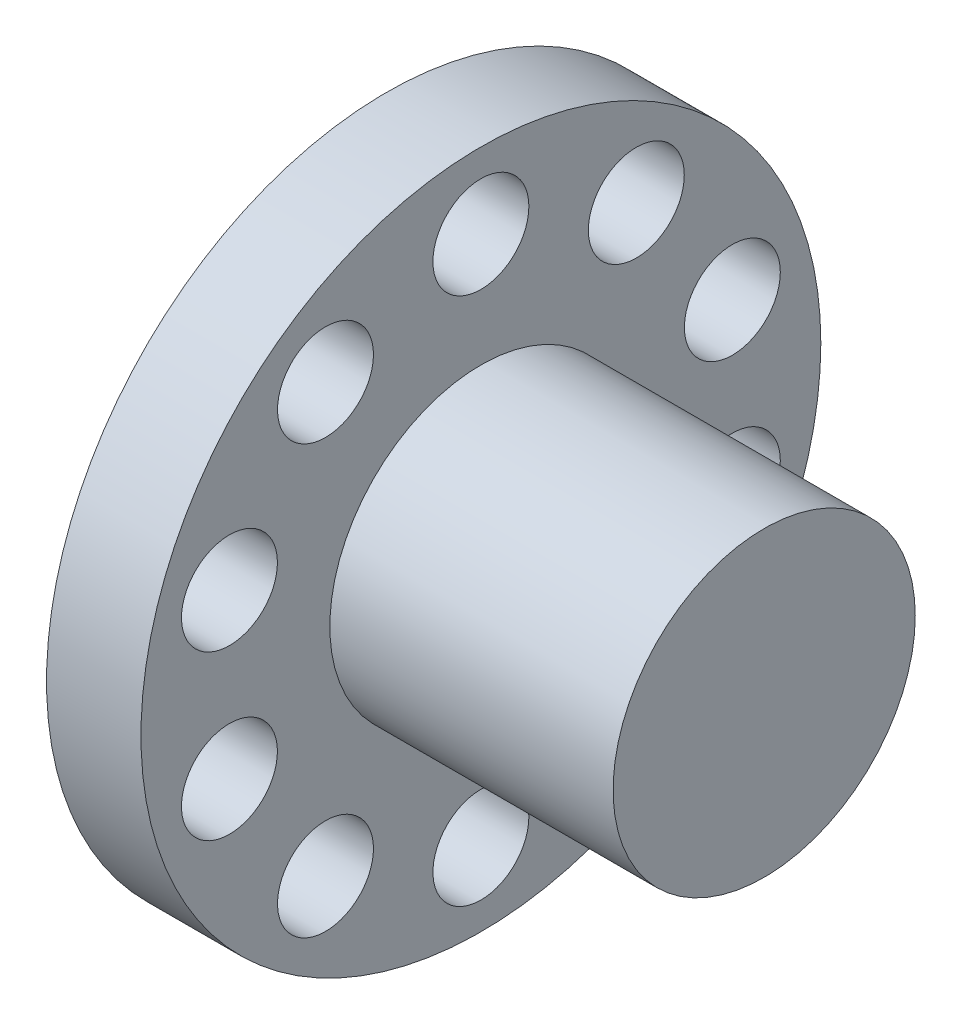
from build123d import *

# Parameters (mm, degrees)
SZKIC_OTWORU_MOCOWANIA_R = 12.7
OTW_R_MOCOWANIA_DEPTH    = 162.864140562
POWIELENIE_OTWOR_W_COUNT = 10


with BuildPart() as part:
    # Szkic bazowy → Obr_t bazowy (revolve)
    with BuildSketch(Plane.XY, mode=Mode.PRIVATE) as obr_t_bazowy_sk:
        Polygon((0, 0), (0, 90), (25, 90), (25, 40), (100, 40), (100, 0), align=None)
    revolve(obr_t_bazowy_sk.sketch.rotate(Axis((0, 0, 0), (-1, 0, 0)), 90), axis=Axis((0, 0, 0), (-1, 0, 0)))

    # Szkic otworu mocowania → Otw_r mocowania (cut, through all)
    with BuildSketch(Plane.ZY):
        with Locations((0, 70)):
            Circle(SZKIC_OTWORU_MOCOWANIA_R)
    otw_r_mocowania = extrude(amount=-OTW_R_MOCOWANIA_DEPTH, mode=Mode.SUBTRACT)

    # Powielenie otwor_w: Otw_r mocowania ×10 about axis
    powielenie_otwor_w_axis = Axis((0, 0, 0), (1, 0, 0))
    for i in range(1, POWIELENIE_OTWOR_W_COUNT):
        add(otw_r_mocowania.rotate(powielenie_otwor_w_axis, i * 360 / POWIELENIE_OTWOR_W_COUNT), mode=Mode.SUBTRACT)


solid = part.part
